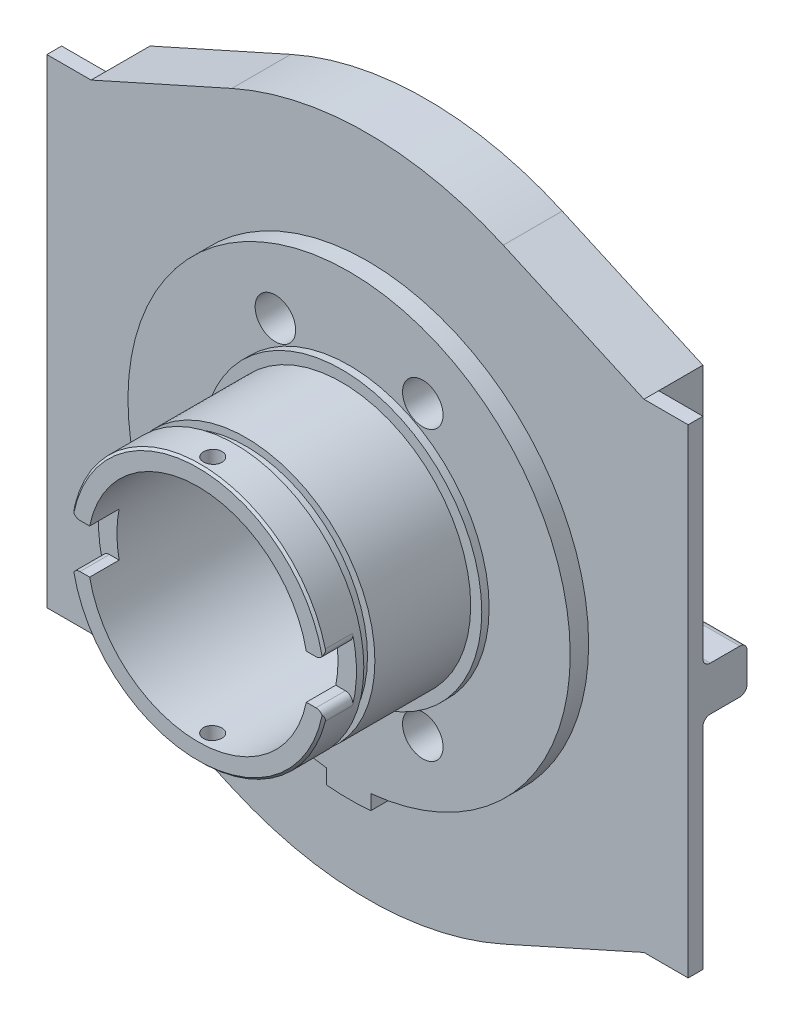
from build123d import *

# Parameters (mm, degrees)
SKETCH_1_R               = 15
EXTRUDE_1_DEPTH          = 4
HOLE_WIZARD_M3_1_D       = 2.5
SKETCH_4_R               = 17.5
SKETCH_4_R_2             = 15
EXTRUDE_2_DEPTH          = 23
SKETCH_5_R               = 19
SKETCH_5_R_2             = 17.5
EXTRUDE_3_DEPTH          = 3.5
CUT_EXTRUDE_1_DEPTH      = 69.163406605
CUT_EXTRUDE_1_DEPTH_BACK = 69.163406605
SKETCH_6_W               = 6
SKETCH_6_H               = 6
HOLE_WIZARD_M3_2_D       = 2.5
HOLE_WIZARD_M3_2_DEPTH   = 6.5
HOLE_WIZARD_M3_2_TIP     = 0.751075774
HOLE_WIZARD_M3_3_D       = 2.5
HOLE_WIZARD_M3_3_DEPTH   = 6.5
HOLE_WIZARD_M3_3_TIP     = 0.751075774
SKETCH_14_W              = 6
SKETCH_14_H              = 6
EXTRUDE_4_DEPTH          = 6
FILLET_1_R               = 1
FILLET_2_R               = 1
CHAMFER_1_SIZE           = 0.3
SKETCH_15_W              = 36
SKETCH_15_H              = 6
CUT_EXTRUDE_2_DEPTH      = 4
SKETCH_17_W              = 1
SKETCH_17_H              = 1.5
FILLET_7_R               = 1
SKETCH_18_R              = 1.25
CUT_EXTRUDE_3_DEPTH      = 19
SKETCH_19_R              = 2.75
CUT_EXTRUDE_4_DEPTH      = 1.5
EXTRUDE_START            = 2.5
SKETCH_20_R              = 30
SKETCH_20_R_2            = 2.75
SKETCH_20_R_3            = 19
EXTRUDE_5_DEPTH          = 2.5
EXTRUDE_6_DEPTH          = 2.5


with BuildPart() as part:
    # Sketch 1 → Extrude 1 (new, symmetric)
    with BuildSketch(Plane.XY):
        with BuildLine():
            Line((-18.41507321, 41.059530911), (-37.5, 32.5))
            Line((-37.5, 32.5), (-43.5, 32.5))
            Line((-43.5, 32.5), (-43.5, -32.5))
            Line((-43.5, -32.5), (-37.5, -32.5))
            Line((-37.5, -32.5), (-18.41507321, -41.059530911))
            ThreePointArc((-18.41507321, -41.059530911), (0, -45), (18.41507321, -41.059530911))
            Line((18.41507321, -41.059530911), (37.5, -32.5))
            Line((37.5, -32.5), (43.5, -32.5))
            Line((43.5, -32.5), (43.5, 32.5))
            Line((43.5, 32.5), (37.5, 32.5))
            Line((37.5, 32.5), (18.41507321, 41.059530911))
            ThreePointArc((18.41507321, 41.059530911), (0, 45), (-18.41507321, 41.059530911))
        make_face()
        Circle(SKETCH_1_R, mode=Mode.SUBTRACT)
    extrude(amount=EXTRUDE_1_DEPTH, both=True)

    # Hole Wizard M3 _1 (through all)
    with Locations(Plane(origin=(-10, 19.5, 4), x_dir=(1, 0, 0), z_dir=(0, 0, 1))):
        with Locations((0, 0), (20, 0), (0, -39), (20, -39)):
            Hole(HOLE_WIZARD_M3_1_D / 2)

    # Sketch 4 → Extrude 2 (add)
    with BuildSketch(Plane.XY.offset(4)):
        Circle(SKETCH_4_R)
        Circle(SKETCH_4_R_2, mode=Mode.SUBTRACT)
    extrude(amount=EXTRUDE_2_DEPTH)

    # Sketch 5 → Extrude 3 (add)
    with BuildSketch(Plane.XY.offset(4)):
        Circle(SKETCH_5_R)
        Circle(SKETCH_5_R_2, mode=Mode.SUBTRACT)
    extrude(amount=EXTRUDE_3_DEPTH)

    # Sketch 6 → Cut-Extrude 1 (cut, two sides: drawn at the far end of the back side and taken through both)
    with BuildSketch(Plane(origin=(0, 0, 0), x_dir=(1, 0, 0), z_dir=(0, 1, 0)).offset(-CUT_EXTRUDE_1_DEPTH_BACK)):
        with Locations((-40.5, 1)):
            Rectangle(SKETCH_6_W, SKETCH_6_H)
        with Locations((40.5, 1)):
            Rectangle(SKETCH_6_W, SKETCH_6_H)
    extrude(amount=CUT_EXTRUDE_1_DEPTH + CUT_EXTRUDE_1_DEPTH_BACK, mode=Mode.SUBTRACT)

    # Hole Wizard M3 _2
    with Locations(Plane(origin=(-37.5, 20, -2), x_dir=(0, 0, -1), z_dir=(-1, 0, 0))):
        with Locations((0, 0), (0, 40)):
            Hole(HOLE_WIZARD_M3_2_D / 2, depth=HOLE_WIZARD_M3_2_DEPTH)
            with Locations((0, 0, -(HOLE_WIZARD_M3_2_DEPTH + HOLE_WIZARD_M3_2_TIP / 2))):  # 118° drill point
                Cone(0, HOLE_WIZARD_M3_2_D / 2, HOLE_WIZARD_M3_2_TIP, mode=Mode.SUBTRACT)

    # Hole Wizard M3 _3
    with Locations(Plane(origin=(37.5, 20, -2), x_dir=(0, 0, 1), z_dir=(1, 0, 0))):
        with Locations((0, 0), (0, 40)):
            Hole(HOLE_WIZARD_M3_3_D / 2, depth=HOLE_WIZARD_M3_3_DEPTH)
            with Locations((0, 0, -(HOLE_WIZARD_M3_3_DEPTH + HOLE_WIZARD_M3_3_TIP / 2))):  # 118° drill point
                Cone(0, HOLE_WIZARD_M3_3_D / 2, HOLE_WIZARD_M3_3_TIP, mode=Mode.SUBTRACT)

    # Sketch 14 → Extrude 4 (add)
    with BuildSketch(Plane.ZY.offset(37.5)):
        with Locations((-1, 0)):
            Rectangle(SKETCH_14_W, SKETCH_14_H)
    extrude_4 = extrude(amount=EXTRUDE_4_DEPTH)

    # Fillet 1
    fillet_1_edges = [part.edges().sort_by_distance(p)[0] for p in [
        (-40.5, -3, 2),
        (-40.5, 3, 2),
        (-40.5, 3, -4),
        (-40.5, -3, -4),
    ]]
    fillet(fillet_1_edges, radius=FILLET_1_R)

    # Mirror 1: Extrude 4 across plane
    add(extrude_4.mirror(Plane(origin=(0, 0, 0), x_dir=(0, 0, 1), z_dir=(1, 0, 0))))

    # Fillet 2
    fillet_2_edges = [part.edges().sort_by_distance(p)[0] for p in [
        (40.5, 3, 2),
        (40.5, -3, 2),
        (40.5, -3, -4),
        (40.5, 3, -4),
    ]]
    fillet(fillet_2_edges, radius=FILLET_2_R)

    # Chamfer 1
    chamfer_1_edges = [part.edges().sort_by_distance(p)[0] for p in [
        (-17.5, 0, 27),
    ]]
    chamfer(chamfer_1_edges, length=CHAMFER_1_SIZE)

    # Sketch 15 → Cut-Extrude 2 (cut)
    with BuildSketch(Plane.XY.offset(27)):
        Rectangle(SKETCH_15_W, SKETCH_15_H)
    extrude(amount=-CUT_EXTRUDE_2_DEPTH, mode=Mode.SUBTRACT)

    # Sketch 17 → Cut-Revolve 1 (revolve, cut)
    with BuildSketch(Plane(origin=(0, 0, 0), x_dir=(1, 0, 0), z_dir=(0, 1, 0)), mode=Mode.PRIVATE) as cut_revolve_1_sk:
        with Locations((-17, -21.25)):
            Rectangle(SKETCH_17_W, SKETCH_17_H)
    revolve(cut_revolve_1_sk.sketch.rotate(Axis((0, 0, 4), (0, 0, -1)), 180), axis=Axis((0, 0, 4), (0, 0, -1)), mode=Mode.SUBTRACT)

    # Fillet 7
    fillet_7_edges = [part.edges().sort_by_distance(p)[0] for p in [
        (17.24093965, -3, 24.85),
        (-17.24093965, -3, 24.85),
        (-17.24093965, 3, 24.85),
        (17.24093965, 3, 24.85),
    ]]
    fillet(fillet_7_edges, radius=FILLET_7_R)

    # Sketch 18 → Cut-Extrude 3 (cut, symmetric)
    with BuildSketch(Plane(origin=(0, 0, 0), x_dir=(1, 0, 0), z_dir=(0, 1, 0))):
        with Locations(Location((0, -25, 0), (0, 0, 270))):
            Circle(SKETCH_18_R)
    extrude(amount=CUT_EXTRUDE_3_DEPTH, both=True, mode=Mode.SUBTRACT)

    # Sketch 19 → Cut-Extrude 4 (cut)
    with BuildSketch(Plane.XY.offset(4)):
        with Locations((10, 19.5)):
            Circle(SKETCH_19_R)
        with Locations((-10, 19.5)):
            Circle(SKETCH_19_R)
        with Locations((-10, -19.5)):
            Circle(SKETCH_19_R)
        with Locations((10, -19.5)):
            Circle(SKETCH_19_R)
    extrude(amount=-CUT_EXTRUDE_4_DEPTH, mode=Mode.SUBTRACT)

    # Sketch 20 → Extrude 5 (add)
    with BuildSketch(Plane.XY.offset(4).offset(EXTRUDE_START)):
        Circle(SKETCH_20_R)
        with Locations((10, -19.5)):
            Circle(SKETCH_20_R_2, mode=Mode.SUBTRACT)
        with Locations((-10, -19.5)):
            Circle(SKETCH_20_R_2, mode=Mode.SUBTRACT)
        with Locations((10, 19.5)):
            Circle(SKETCH_20_R_2, mode=Mode.SUBTRACT)
        with Locations((-10, 19.5)):
            Circle(SKETCH_20_R_2, mode=Mode.SUBTRACT)
        Circle(SKETCH_20_R_3, mode=Mode.SUBTRACT)
    extrude(amount=-EXTRUDE_5_DEPTH)

    # Sketch 21 → Extrude 6 (add)
    with BuildSketch(Plane.XY.offset(6.5)):
        with BuildLine():
            Line((-3.050847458, -31.854235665), (-3.050847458, -29.844468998))
            ThreePointArc((-3.050847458, -29.844468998), (-0.051103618, -29.999956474), (2.949152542, -29.854689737))
            Line((2.949152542, -29.854689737), (2.949152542, -31.863811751))
            ThreePointArc((2.949152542, -31.863811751), (-0.051072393, -31.999959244), (-3.050847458, -31.854235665))
        make_face()
    extrude(amount=-EXTRUDE_6_DEPTH)


solid = part.part
